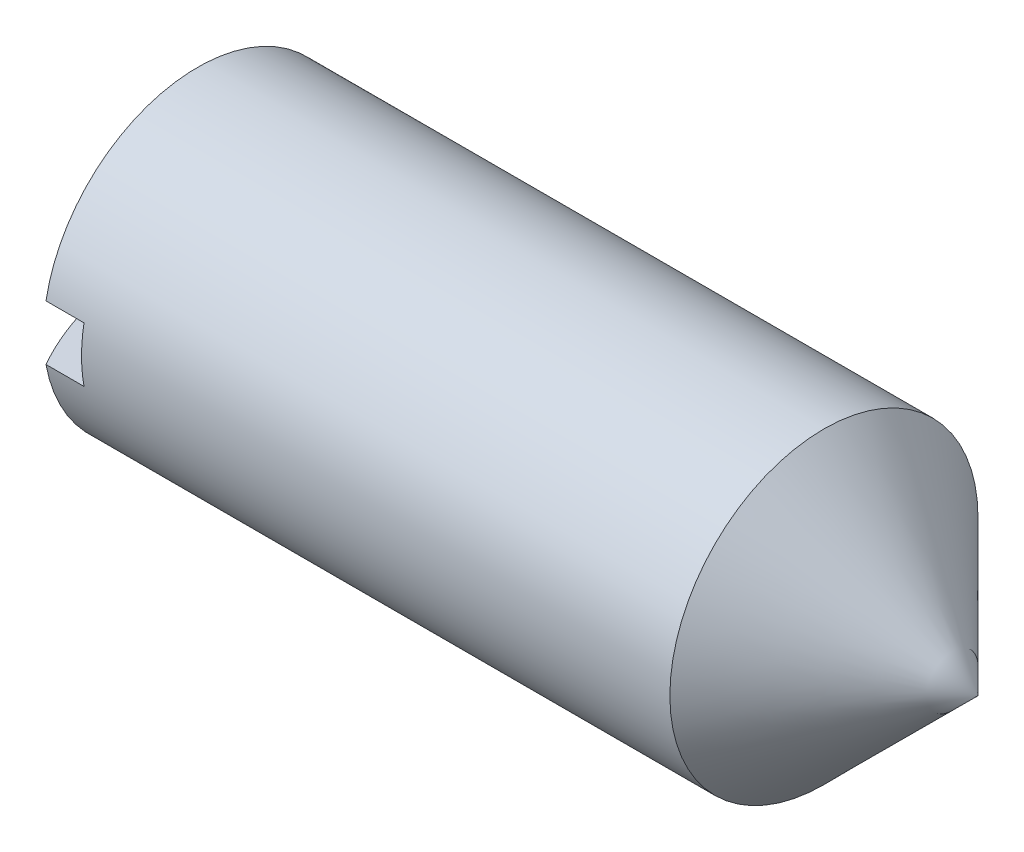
from build123d import *

# Parameters (mm, degrees)
SKETCH2_W  = 19.05
SKETCH2_H  = 3.4036
SLOT_DEPTH = 4.9022


with BuildPart() as part:
    # BodySke → BaseBody (revolve)
    with BuildSketch(Plane.XY, mode=Mode.PRIVATE) as basebody_sk:
        with BuildLine():
            Line((41.275, 9.525), (50.8, 0))
            Line((50.8, 0), (0, 0))
            ThreePointArc((0, 0), (0.649113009, 4.930502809), (2.552216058, 9.525))
            Line((2.552216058, 9.525), (41.275, 9.525))
        make_face()
    revolve(basebody_sk.sketch.rotate(Axis((-12.7, 0, 0), (1, 0, 0)), 90), axis=Axis((-12.7, 0, 0), (1, 0, 0)))

    # ThdSchSke one side (on Top Plane) → ThreadSchematic (revolve, cut)
    with BuildSketch(Plane(origin=(0, 0, 0), x_dir=(1, 0, 0), z_dir=(0, 1, 0))):
        Polygon((3.611328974, -9.525), (2.552216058, -8.01243), (2.552216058, -11.90625), (3.611328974, -11.90625), align=None)
    revolve(axis=Axis((2.552216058, 0, 9.525), (0, 0, -1)), mode=Mode.SUBTRACT)

    # Sketch2 → Slot (cut)
    with BuildSketch(Plane(origin=(0, 0, 0), x_dir=(0, 0, -1), z_dir=(1, 0, 0))):
        Rectangle(SKETCH2_W, SKETCH2_H)
    extrude(amount=SLOT_DEPTH, mode=Mode.SUBTRACT)


solid = part.part
